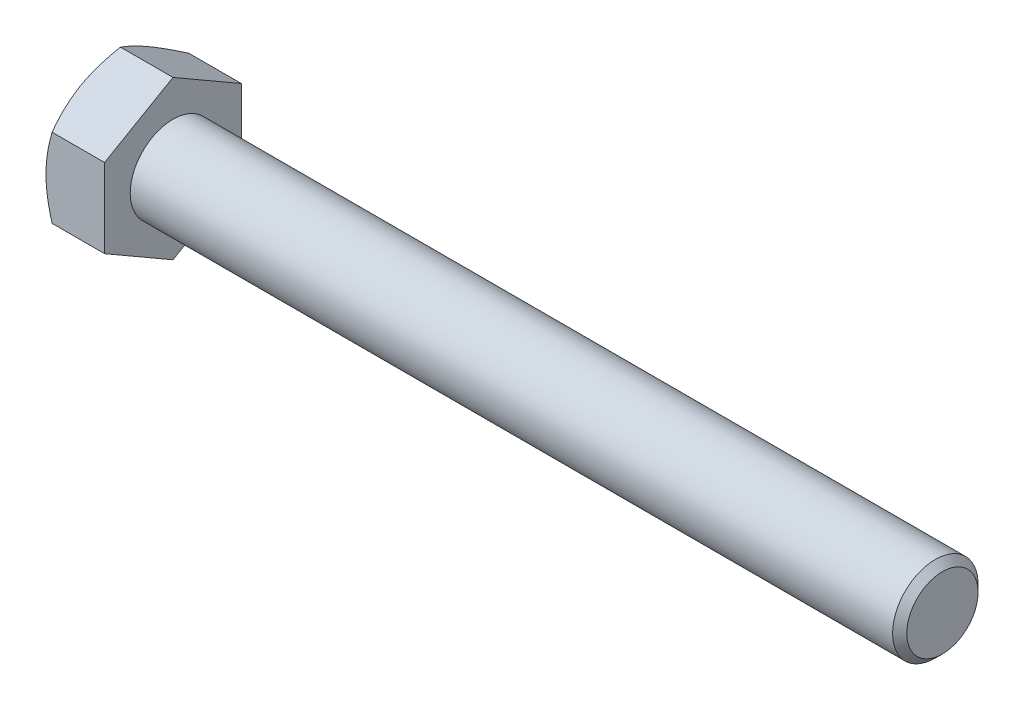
from build123d import *

# Parameters (mm, degrees)
BASEHEAD_DEPTH = 6.85


with BuildPart() as part:
    # Sketch1 → BaseHead (new body)
    with BuildSketch(Plane(origin=(0, 0, 0), x_dir=(0, 0, -1), z_dir=(1, 0, 0))):
        Polygon((8, 4.618802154), (8, -4.618802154), (0, -9.237604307), (-8, -4.618802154), (-8, 4.618802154), (0, 9.237604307), align=None)
    extrude(amount=BASEHEAD_DEPTH)

    # BodySke → BaseBody (revolve)
    with BuildSketch(Plane.XY, mode=Mode.PRIVATE) as basebody_sk:
        Polygon((0, 0), (96.85, 0), (96.85, 4.172), (96.022, 5), (0, 5), align=None)
    revolve(basebody_sk.sketch.rotate(Axis((0, 0, 0), (1, 0, 0)), 90), axis=Axis((0, 0, 0), (1, 0, 0)))

    # Sketch3 → HeadChamfer (revolve, cut)
    with BuildSketch(Plane.XY):
        Polygon((0, 8), (3.601282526, 14.237604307), (3.601282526, 19.237604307), (-10, 19.237604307), (-10, 8), align=None)
    revolve(axis=Axis((0, 0, 0), (1, 0, 0)), mode=Mode.SUBTRACT)


solid = part.part
